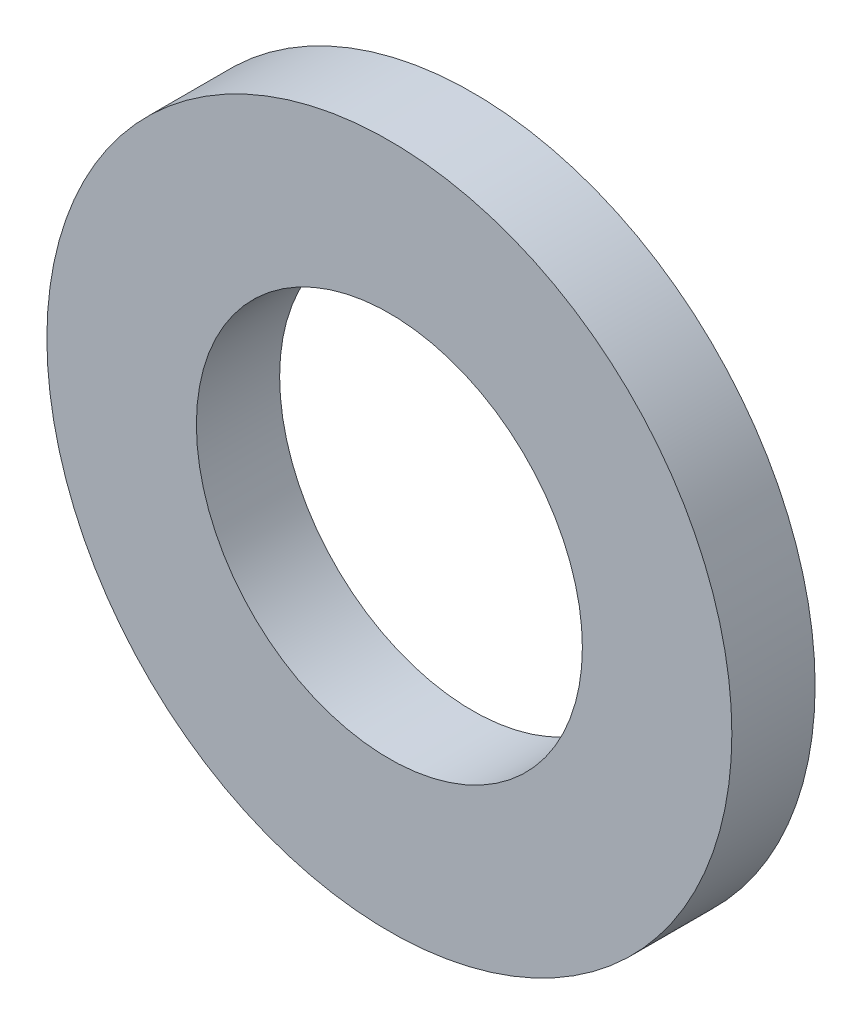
ISO-10303-21;
HEADER;
FILE_DESCRIPTION(('STEP AP214'),'2;1');
FILE_NAME('part.step','',(''),(''),'','','');
FILE_SCHEMA(('AUTOMOTIVE_DESIGN { 1 0 10303 214 1 1 1 1 }'));
ENDSEC;
DATA;
#1=APPLICATION_CONTEXT('core data for automotive mechanical design processes');
#2=APPLICATION_PROTOCOL_DEFINITION('international standard','automotive_design',2000,#1);
#3=PRODUCT_CONTEXT('',#1,'mechanical');
#4=PRODUCT('Part','Part','',(#3));
#5=PRODUCT_RELATED_PRODUCT_CATEGORY('part','',(#4));
#6=PRODUCT_DEFINITION_FORMATION('','',#4);
#7=PRODUCT_DEFINITION_CONTEXT('part definition',#1,'design');
#8=PRODUCT_DEFINITION('design','',#6,#7);
#9=PRODUCT_DEFINITION_SHAPE('','',#8);
#10=(LENGTH_UNIT() NAMED_UNIT(*) SI_UNIT(.MILLI.,.METRE.));
#11=(NAMED_UNIT(*) PLANE_ANGLE_UNIT() SI_UNIT($,.RADIAN.));
#12=(NAMED_UNIT(*) SI_UNIT($,.STERADIAN.) SOLID_ANGLE_UNIT());
#13=UNCERTAINTY_MEASURE_WITH_UNIT(LENGTH_MEASURE(1.E-05),#10,'distance_accuracy_value','');
#14=(GEOMETRIC_REPRESENTATION_CONTEXT(3) GLOBAL_UNCERTAINTY_ASSIGNED_CONTEXT((#13)) GLOBAL_UNIT_ASSIGNED_CONTEXT((#10,
#11,#12)) REPRESENTATION_CONTEXT('',''));
#15=CARTESIAN_POINT('',(0.,0.,0.));
#16=DIRECTION('',(0.,0.,1.));
#17=DIRECTION('',(1.,0.,0.));
#18=AXIS2_PLACEMENT_3D('',#15,#16,#17);
#19=CARTESIAN_POINT('',(0.,0.,2.2));
#20=DIRECTION('',(0.,0.,1.));
#21=DIRECTION('',(1.,0.,0.));
#22=AXIS2_PLACEMENT_3D('',#19,#20,#21);
#23=PLANE('',#22);
#24=CARTESIAN_POINT('',(0.,0.,2.2));
#25=DIRECTION('',(0.,0.,1.));
#26=DIRECTION('',(1.,0.,0.));
#27=AXIS2_PLACEMENT_3D('',#24,#25,#26);
#28=CIRCLE('',#27,9.05);
#29=CARTESIAN_POINT('',(9.05,0.,2.2));
#30=VERTEX_POINT('',#29);
#31=EDGE_CURVE('E10',#30,#30,#28,.T.);
#32=ORIENTED_EDGE('',*,*,#31,.T.);
#33=EDGE_LOOP('',(#32));
#34=FACE_BOUND('',#33,.T.);
#35=CARTESIAN_POINT('',(0.,0.,2.2));
#36=DIRECTION('',(0.,0.,1.));
#37=DIRECTION('',(1.,0.,0.));
#38=AXIS2_PLACEMENT_3D('',#35,#36,#37);
#39=CIRCLE('',#38,5.1);
#40=CARTESIAN_POINT('',(5.1,0.,2.2));
#41=VERTEX_POINT('',#40);
#42=EDGE_CURVE('E54',#41,#41,#39,.T.);
#43=ORIENTED_EDGE('',*,*,#42,.F.);
#44=EDGE_LOOP('',(#43));
#45=FACE_BOUND('',#44,.T.);
#46=ADVANCED_FACE('F41',(#34,#45),#23,.T.);
#47=CARTESIAN_POINT('',(0.,0.,0.));
#48=DIRECTION('',(0.,0.,1.));
#49=DIRECTION('',(1.,0.,0.));
#50=AXIS2_PLACEMENT_3D('',#47,#48,#49);
#51=PLANE('',#50);
#52=CARTESIAN_POINT('',(0.,0.,0.));
#53=DIRECTION('',(0.,0.,1.));
#54=DIRECTION('',(1.,0.,0.));
#55=AXIS2_PLACEMENT_3D('',#52,#53,#54);
#56=CIRCLE('',#55,9.05);
#57=CARTESIAN_POINT('',(9.05,0.,0.));
#58=VERTEX_POINT('',#57);
#59=EDGE_CURVE('E45',#58,#58,#56,.T.);
#60=ORIENTED_EDGE('',*,*,#59,.F.);
#61=EDGE_LOOP('',(#60));
#62=FACE_BOUND('',#61,.T.);
#63=CARTESIAN_POINT('',(0.,0.,0.));
#64=DIRECTION('',(0.,0.,1.));
#65=DIRECTION('',(1.,0.,0.));
#66=AXIS2_PLACEMENT_3D('',#63,#64,#65);
#67=CIRCLE('',#66,5.1);
#68=CARTESIAN_POINT('',(5.1,0.,0.));
#69=VERTEX_POINT('',#68);
#70=EDGE_CURVE('E56',#69,#69,#67,.T.);
#71=ORIENTED_EDGE('',*,*,#70,.T.);
#72=EDGE_LOOP('',(#71));
#73=FACE_BOUND('',#72,.T.);
#74=ADVANCED_FACE('F68',(#62,#73),#51,.F.);
#75=CARTESIAN_POINT('',(0.,0.,2.2));
#76=DIRECTION('',(0.,0.,-1.));
#77=DIRECTION('',(-1.,0.,0.));
#78=AXIS2_PLACEMENT_3D('',#75,#76,#77);
#79=CYLINDRICAL_SURFACE('',#78,9.05);
#80=ORIENTED_EDGE('',*,*,#31,.F.);
#81=EDGE_LOOP('',(#80));
#82=FACE_BOUND('',#81,.T.);
#83=ORIENTED_EDGE('',*,*,#59,.T.);
#84=EDGE_LOOP('',(#83));
#85=FACE_BOUND('',#84,.T.);
#86=ADVANCED_FACE('F43',(#82,#85),#79,.T.);
#87=CARTESIAN_POINT('',(0.,0.,2.2));
#88=DIRECTION('',(0.,0.,-1.));
#89=DIRECTION('',(-1.,0.,0.));
#90=AXIS2_PLACEMENT_3D('',#87,#88,#89);
#91=CYLINDRICAL_SURFACE('',#90,5.1);
#92=ORIENTED_EDGE('',*,*,#42,.T.);
#93=EDGE_LOOP('',(#92));
#94=FACE_BOUND('',#93,.T.);
#95=ORIENTED_EDGE('',*,*,#70,.F.);
#96=EDGE_LOOP('',(#95));
#97=FACE_BOUND('',#96,.T.);
#98=ADVANCED_FACE('F64',(#94,#97),#91,.F.);
#99=CLOSED_SHELL('',(#46,#74,#86,#98));
#100=MANIFOLD_SOLID_BREP('B2',#99);
#101=ADVANCED_BREP_SHAPE_REPRESENTATION('',(#18,#100),#14);
#102=SHAPE_DEFINITION_REPRESENTATION(#9,#101);
ENDSEC;
END-ISO-10303-21;
